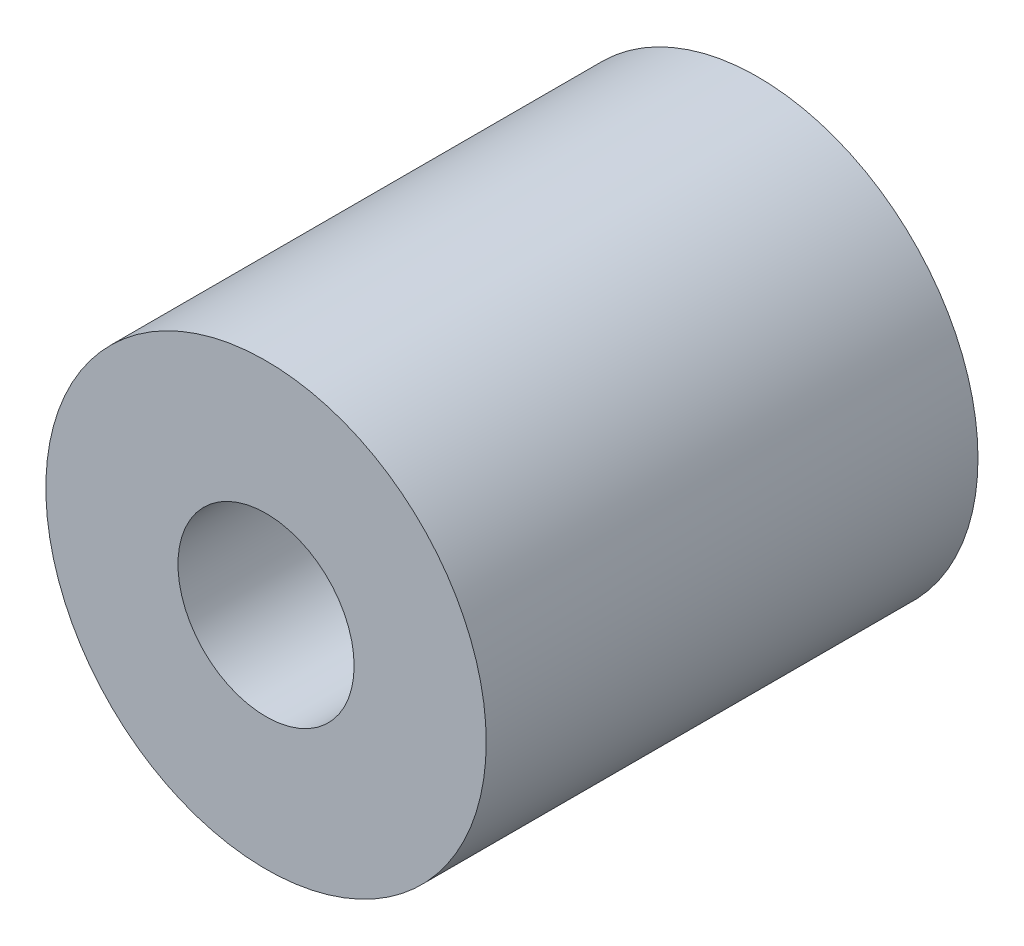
from build123d import *

# Parameters (mm, degrees)
SKETCH1_R           = 15
SKETCH1_R_2         = 6
BOSS_EXTRUDE1_DEPTH = 33.5


with BuildPart() as part:
    # Sketch1 → Boss-Extrude1 (new body)
    with BuildSketch(Plane.XY):
        Circle(SKETCH1_R)
        Circle(SKETCH1_R_2, mode=Mode.SUBTRACT)
    extrude(amount=BOSS_EXTRUDE1_DEPTH)


solid = part.part
